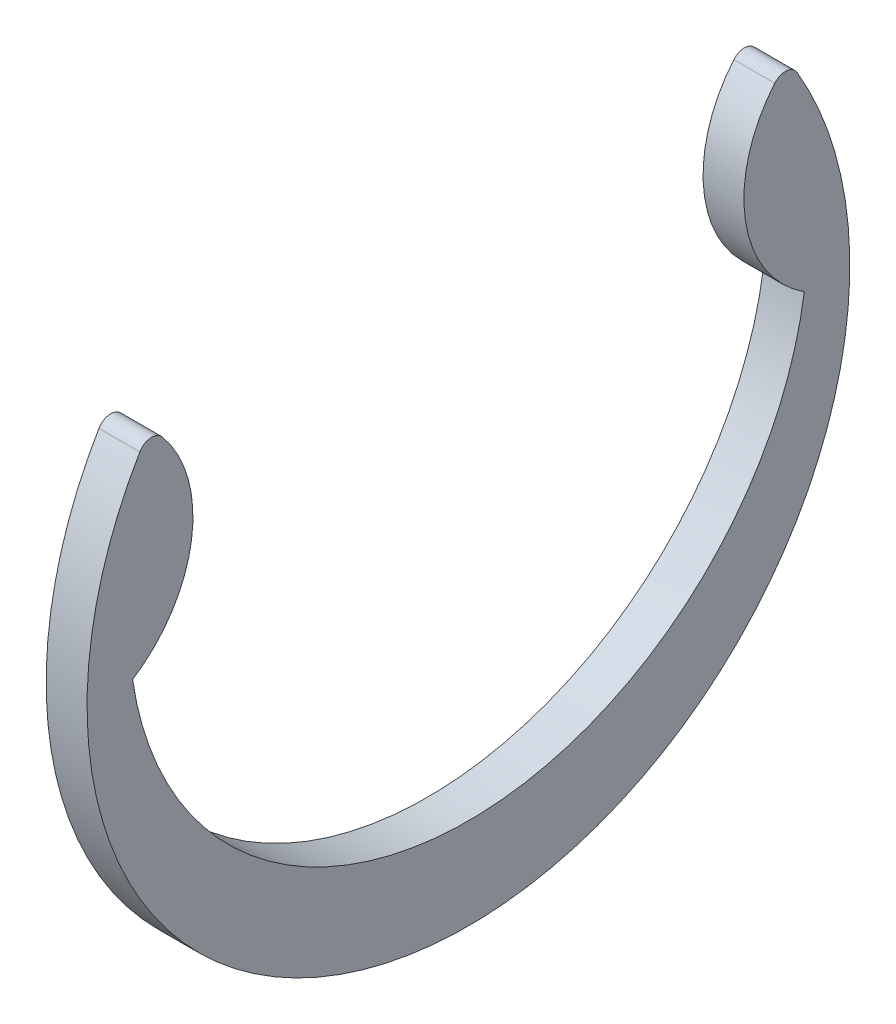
ISO-10303-21;
HEADER;
FILE_DESCRIPTION(('STEP AP214'),'2;1');
FILE_NAME('part.step','',(''),(''),'','','');
FILE_SCHEMA(('AUTOMOTIVE_DESIGN { 1 0 10303 214 1 1 1 1 }'));
ENDSEC;
DATA;
#1=APPLICATION_CONTEXT('core data for automotive mechanical design processes');
#2=APPLICATION_PROTOCOL_DEFINITION('international standard','automotive_design',2000,#1);
#3=PRODUCT_CONTEXT('',#1,'mechanical');
#4=PRODUCT('Part','Part','',(#3));
#5=PRODUCT_RELATED_PRODUCT_CATEGORY('part','',(#4));
#6=PRODUCT_DEFINITION_FORMATION('','',#4);
#7=PRODUCT_DEFINITION_CONTEXT('part definition',#1,'design');
#8=PRODUCT_DEFINITION('design','',#6,#7);
#9=PRODUCT_DEFINITION_SHAPE('','',#8);
#10=(LENGTH_UNIT() NAMED_UNIT(*) SI_UNIT(.MILLI.,.METRE.));
#11=(NAMED_UNIT(*) PLANE_ANGLE_UNIT() SI_UNIT($,.RADIAN.));
#12=(NAMED_UNIT(*) SI_UNIT($,.STERADIAN.) SOLID_ANGLE_UNIT());
#13=UNCERTAINTY_MEASURE_WITH_UNIT(LENGTH_MEASURE(1.E-05),#10,'distance_accuracy_value','');
#14=(GEOMETRIC_REPRESENTATION_CONTEXT(3) GLOBAL_UNCERTAINTY_ASSIGNED_CONTEXT((#13)) GLOBAL_UNIT_ASSIGNED_CONTEXT((#10,
#11,#12)) REPRESENTATION_CONTEXT('',''));
#15=CARTESIAN_POINT('',(0.,0.,0.));
#16=DIRECTION('',(0.,0.,1.));
#17=DIRECTION('',(1.,0.,0.));
#18=AXIS2_PLACEMENT_3D('',#15,#16,#17);
#19=CARTESIAN_POINT('',(0.4445,2.40757501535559,8.85539701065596));
#20=DIRECTION('',(-1.,0.,0.));
#21=DIRECTION('',(0.,0.,1.));
#22=AXIS2_PLACEMENT_3D('',#19,#20,#21);
#23=CYLINDRICAL_SURFACE('',#22,2.86494442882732);
#24=CARTESIAN_POINT('',(-0.4445,2.40757501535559,8.85539701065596));
#25=DIRECTION('',(1.,0.,0.));
#26=DIRECTION('',(0.,0.,1.));
#27=AXIS2_PLACEMENT_3D('',#24,#25,#26);
#28=CIRCLE('',#27,2.86494442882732);
#29=CARTESIAN_POINT('',(-0.4445,0.,7.3025));
#30=VERTEX_POINT('',#29);
#31=CARTESIAN_POINT('',(-0.4445,4.24828055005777,6.6600132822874));
#32=VERTEX_POINT('',#31);
#33=EDGE_CURVE('E121',#30,#32,#28,.T.);
#34=ORIENTED_EDGE('',*,*,#33,.T.);
#35=DIRECTION('',(-1.,0.,0.));
#36=VECTOR('',#35,1.);
#37=CARTESIAN_POINT('',(0.4445,4.24828055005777,6.6600132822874));
#38=LINE('',#37,#36);
#39=CARTESIAN_POINT('',(0.4445,4.24828055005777,6.6600132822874));
#40=VERTEX_POINT('',#39);
#41=EDGE_CURVE('E11',#40,#32,#38,.T.);
#42=ORIENTED_EDGE('',*,*,#41,.F.);
#43=CARTESIAN_POINT('',(0.4445,2.40757501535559,8.85539701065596));
#44=DIRECTION('',(1.,0.,0.));
#45=DIRECTION('',(0.,0.,1.));
#46=AXIS2_PLACEMENT_3D('',#43,#44,#45);
#47=CIRCLE('',#46,2.86494442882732);
#48=CARTESIAN_POINT('',(0.4445,0.,7.3025));
#49=VERTEX_POINT('',#48);
#50=EDGE_CURVE('E131',#49,#40,#47,.T.);
#51=ORIENTED_EDGE('',*,*,#50,.F.);
#52=DIRECTION('',(-1.,0.,0.));
#53=VECTOR('',#52,1.);
#54=CARTESIAN_POINT('',(0.4445,0.,7.3025));
#55=LINE('',#54,#53);
#56=EDGE_CURVE('E117',#49,#30,#55,.T.);
#57=ORIENTED_EDGE('',*,*,#56,.T.);
#58=EDGE_LOOP('',(#34,#42,#51,#57));
#59=FACE_BOUND('',#58,.T.);
#60=ADVANCED_FACE('F37',(#59),#23,.T.);
#61=CARTESIAN_POINT('',(0.4445,4.05638902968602,6.88887961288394));
#62=DIRECTION('',(-1.,0.,0.));
#63=DIRECTION('',(0.,0.,1.));
#64=AXIS2_PLACEMENT_3D('',#61,#62,#63);
#65=CYLINDRICAL_SURFACE('',#64,0.298667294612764);
#66=CARTESIAN_POINT('',(-0.4445,4.05638902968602,6.88887961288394));
#67=DIRECTION('',(1.,0.,0.));
#68=DIRECTION('',(0.,0.,1.));
#69=AXIS2_PLACEMENT_3D('',#66,#67,#68);
#70=CIRCLE('',#69,0.298667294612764);
#71=CARTESIAN_POINT('',(-0.4445,4.20793333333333,7.14624409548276));
#72=VERTEX_POINT('',#71);
#73=EDGE_CURVE('E124',#32,#72,#70,.T.);
#74=ORIENTED_EDGE('',*,*,#73,.T.);
#75=DIRECTION('',(-1.,0.,0.));
#76=VECTOR('',#75,1.);
#77=CARTESIAN_POINT('',(0.4445,4.20793333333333,7.14624409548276));
#78=LINE('',#77,#76);
#79=CARTESIAN_POINT('',(0.4445,4.20793333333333,7.14624409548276));
#80=VERTEX_POINT('',#79);
#81=EDGE_CURVE('E45',#80,#72,#78,.T.);
#82=ORIENTED_EDGE('',*,*,#81,.F.);
#83=CARTESIAN_POINT('',(0.4445,4.05638902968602,6.88887961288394));
#84=DIRECTION('',(1.,0.,0.));
#85=DIRECTION('',(0.,0.,1.));
#86=AXIS2_PLACEMENT_3D('',#83,#84,#85);
#87=CIRCLE('',#86,0.298667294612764);
#88=EDGE_CURVE('E90',#40,#80,#87,.T.);
#89=ORIENTED_EDGE('',*,*,#88,.F.);
#90=ORIENTED_EDGE('',*,*,#41,.T.);
#91=EDGE_LOOP('',(#74,#82,#89,#90));
#92=FACE_BOUND('',#91,.T.);
#93=ADVANCED_FACE('F155',(#92),#65,.T.);
#94=CARTESIAN_POINT('',(0.4445,0.,0.));
#95=DIRECTION('',(-1.,0.,0.));
#96=DIRECTION('',(0.,0.,1.));
#97=AXIS2_PLACEMENT_3D('',#94,#95,#96);
#98=CYLINDRICAL_SURFACE('',#97,8.2931);
#99=CARTESIAN_POINT('',(-0.4445,0.,0.));
#100=DIRECTION('',(1.,0.,0.));
#101=DIRECTION('',(0.,0.,1.));
#102=AXIS2_PLACEMENT_3D('',#99,#100,#101);
#103=CIRCLE('',#102,8.2931);
#104=CARTESIAN_POINT('',(-0.4445,4.20793333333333,-7.14624409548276));
#105=VERTEX_POINT('',#104);
#106=EDGE_CURVE('E126',#72,#105,#103,.T.);
#107=ORIENTED_EDGE('',*,*,#106,.T.);
#108=DIRECTION('',(-1.,0.,0.));
#109=VECTOR('',#108,1.);
#110=CARTESIAN_POINT('',(0.4445,4.20793333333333,-7.14624409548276));
#111=LINE('',#110,#109);
#112=CARTESIAN_POINT('',(0.4445,4.20793333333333,-7.14624409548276));
#113=VERTEX_POINT('',#112);
#114=EDGE_CURVE('E112',#113,#105,#111,.T.);
#115=ORIENTED_EDGE('',*,*,#114,.F.);
#116=CARTESIAN_POINT('',(0.4445,0.,0.));
#117=DIRECTION('',(1.,0.,0.));
#118=DIRECTION('',(0.,0.,1.));
#119=AXIS2_PLACEMENT_3D('',#116,#117,#118);
#120=CIRCLE('',#119,8.2931);
#121=EDGE_CURVE('E103',#80,#113,#120,.T.);
#122=ORIENTED_EDGE('',*,*,#121,.F.);
#123=ORIENTED_EDGE('',*,*,#81,.T.);
#124=EDGE_LOOP('',(#107,#115,#122,#123));
#125=FACE_BOUND('',#124,.T.);
#126=ADVANCED_FACE('F137',(#125),#98,.T.);
#127=CARTESIAN_POINT('',(0.4445,4.05638902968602,-6.88887961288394));
#128=DIRECTION('',(-1.,0.,0.));
#129=DIRECTION('',(0.,0.,1.));
#130=AXIS2_PLACEMENT_3D('',#127,#128,#129);
#131=CYLINDRICAL_SURFACE('',#130,0.298667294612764);
#132=CARTESIAN_POINT('',(-0.4445,4.05638902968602,-6.88887961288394));
#133=DIRECTION('',(1.,0.,0.));
#134=DIRECTION('',(0.,0.,-1.));
#135=AXIS2_PLACEMENT_3D('',#132,#133,#134);
#136=CIRCLE('',#135,0.298667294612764);
#137=CARTESIAN_POINT('',(-0.4445,4.24828055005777,-6.6600132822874));
#138=VERTEX_POINT('',#137);
#139=EDGE_CURVE('E111',#105,#138,#136,.T.);
#140=ORIENTED_EDGE('',*,*,#139,.T.);
#141=DIRECTION('',(-1.,0.,0.));
#142=VECTOR('',#141,1.);
#143=CARTESIAN_POINT('',(0.4445,4.24828055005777,-6.6600132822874));
#144=LINE('',#143,#142);
#145=CARTESIAN_POINT('',(0.4445,4.24828055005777,-6.6600132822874));
#146=VERTEX_POINT('',#145);
#147=EDGE_CURVE('E108',#146,#138,#144,.T.);
#148=ORIENTED_EDGE('',*,*,#147,.F.);
#149=CARTESIAN_POINT('',(0.4445,4.05638902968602,-6.88887961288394));
#150=DIRECTION('',(1.,0.,0.));
#151=DIRECTION('',(0.,0.,-1.));
#152=AXIS2_PLACEMENT_3D('',#149,#150,#151);
#153=CIRCLE('',#152,0.298667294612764);
#154=EDGE_CURVE('E97',#113,#146,#153,.T.);
#155=ORIENTED_EDGE('',*,*,#154,.F.);
#156=ORIENTED_EDGE('',*,*,#114,.T.);
#157=EDGE_LOOP('',(#140,#148,#155,#156));
#158=FACE_BOUND('',#157,.T.);
#159=ADVANCED_FACE('F109',(#158),#131,.T.);
#160=CARTESIAN_POINT('',(0.4445,2.40757501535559,-8.85539701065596));
#161=DIRECTION('',(-1.,0.,0.));
#162=DIRECTION('',(0.,0.,1.));
#163=AXIS2_PLACEMENT_3D('',#160,#161,#162);
#164=CYLINDRICAL_SURFACE('',#163,2.86494442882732);
#165=CARTESIAN_POINT('',(-0.4445,2.40757501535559,-8.85539701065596));
#166=DIRECTION('',(1.,0.,0.));
#167=DIRECTION('',(0.,0.,1.));
#168=AXIS2_PLACEMENT_3D('',#165,#166,#167);
#169=CIRCLE('',#168,2.86494442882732);
#170=CARTESIAN_POINT('',(-0.4445,0.,-7.3025));
#171=VERTEX_POINT('',#170);
#172=EDGE_CURVE('E76',#138,#171,#169,.T.);
#173=ORIENTED_EDGE('',*,*,#172,.T.);
#174=DIRECTION('',(-1.,0.,0.));
#175=VECTOR('',#174,1.);
#176=CARTESIAN_POINT('',(0.4445,0.,-7.3025));
#177=LINE('',#176,#175);
#178=CARTESIAN_POINT('',(0.4445,0.,-7.3025));
#179=VERTEX_POINT('',#178);
#180=EDGE_CURVE('E113',#179,#171,#177,.T.);
#181=ORIENTED_EDGE('',*,*,#180,.F.);
#182=CARTESIAN_POINT('',(0.4445,2.40757501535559,-8.85539701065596));
#183=DIRECTION('',(1.,0.,0.));
#184=DIRECTION('',(0.,0.,1.));
#185=AXIS2_PLACEMENT_3D('',#182,#183,#184);
#186=CIRCLE('',#185,2.86494442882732);
#187=EDGE_CURVE('E101',#146,#179,#186,.T.);
#188=ORIENTED_EDGE('',*,*,#187,.F.);
#189=ORIENTED_EDGE('',*,*,#147,.T.);
#190=EDGE_LOOP('',(#173,#181,#188,#189));
#191=FACE_BOUND('',#190,.T.);
#192=ADVANCED_FACE('F115',(#191),#164,.T.);
#193=CARTESIAN_POINT('',(0.4445,1.06833319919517,0.));
#194=DIRECTION('',(-1.,0.,0.));
#195=DIRECTION('',(0.,0.,1.));
#196=AXIS2_PLACEMENT_3D('',#193,#194,#195);
#197=CYLINDRICAL_SURFACE('',#196,7.38023319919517);
#198=CARTESIAN_POINT('',(-0.4445,1.06833319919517,0.));
#199=DIRECTION('',(-1.,0.,0.));
#200=DIRECTION('',(0.,0.,-1.));
#201=AXIS2_PLACEMENT_3D('',#198,#199,#200);
#202=CIRCLE('',#201,7.38023319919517);
#203=EDGE_CURVE('E82',#171,#30,#202,.T.);
#204=ORIENTED_EDGE('',*,*,#203,.T.);
#205=ORIENTED_EDGE('',*,*,#56,.F.);
#206=CARTESIAN_POINT('',(0.4445,1.06833319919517,0.));
#207=DIRECTION('',(-1.,0.,0.));
#208=DIRECTION('',(0.,0.,-1.));
#209=AXIS2_PLACEMENT_3D('',#206,#207,#208);
#210=CIRCLE('',#209,7.38023319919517);
#211=EDGE_CURVE('E53',#179,#49,#210,.T.);
#212=ORIENTED_EDGE('',*,*,#211,.F.);
#213=ORIENTED_EDGE('',*,*,#180,.T.);
#214=EDGE_LOOP('',(#204,#205,#212,#213));
#215=FACE_BOUND('',#214,.T.);
#216=ADVANCED_FACE('F144',(#215),#197,.F.);
#217=CARTESIAN_POINT('',(0.4445,1.73795410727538,4.42769850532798));
#218=DIRECTION('',(-1.,0.,0.));
#219=DIRECTION('',(0.,0.,1.));
#220=AXIS2_PLACEMENT_3D('',#217,#218,#219);
#221=PLANE('',#220);
#222=ORIENTED_EDGE('',*,*,#50,.T.);
#223=ORIENTED_EDGE('',*,*,#88,.T.);
#224=ORIENTED_EDGE('',*,*,#121,.T.);
#225=ORIENTED_EDGE('',*,*,#154,.T.);
#226=ORIENTED_EDGE('',*,*,#187,.T.);
#227=ORIENTED_EDGE('',*,*,#211,.T.);
#228=EDGE_LOOP('',(#222,#223,#224,#225,#226,#227));
#229=FACE_BOUND('',#228,.T.);
#230=ADVANCED_FACE('F99',(#229),#221,.F.);
#231=CARTESIAN_POINT('',(-0.4445,1.73795410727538,4.42769850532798));
#232=DIRECTION('',(-1.,0.,0.));
#233=DIRECTION('',(0.,0.,1.));
#234=AXIS2_PLACEMENT_3D('',#231,#232,#233);
#235=PLANE('',#234);
#236=ORIENTED_EDGE('',*,*,#33,.F.);
#237=ORIENTED_EDGE('',*,*,#203,.F.);
#238=ORIENTED_EDGE('',*,*,#172,.F.);
#239=ORIENTED_EDGE('',*,*,#139,.F.);
#240=ORIENTED_EDGE('',*,*,#106,.F.);
#241=ORIENTED_EDGE('',*,*,#73,.F.);
#242=EDGE_LOOP('',(#236,#237,#238,#239,#240,#241));
#243=FACE_BOUND('',#242,.T.);
#244=ADVANCED_FACE('F140',(#243),#235,.T.);
#245=CLOSED_SHELL('',(#60,#93,#126,#159,#192,#216,#230,#244));
#246=MANIFOLD_SOLID_BREP('B2',#245);
#247=ADVANCED_BREP_SHAPE_REPRESENTATION('',(#18,#246),#14);
#248=SHAPE_DEFINITION_REPRESENTATION(#9,#247);
ENDSEC;
END-ISO-10303-21;
